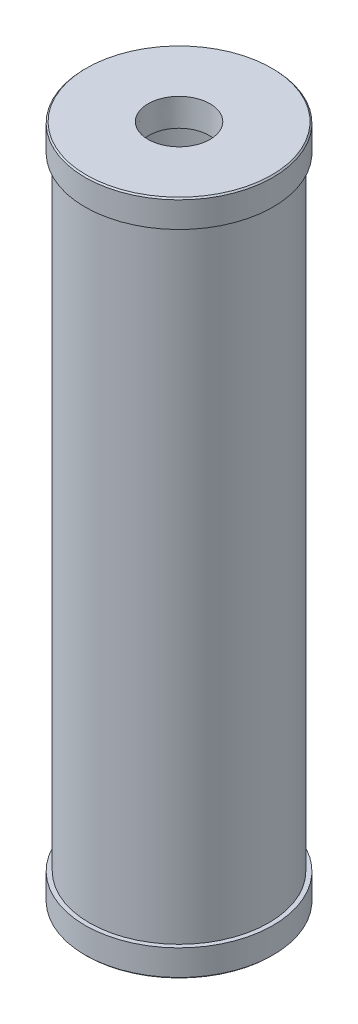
ISO-10303-21;
HEADER;
FILE_DESCRIPTION(('STEP AP214'),'2;1');
FILE_NAME('part.step','',(''),(''),'','','');
FILE_SCHEMA(('AUTOMOTIVE_DESIGN { 1 0 10303 214 1 1 1 1 }'));
ENDSEC;
DATA;
#1=APPLICATION_CONTEXT('core data for automotive mechanical design processes');
#2=APPLICATION_PROTOCOL_DEFINITION('international standard','automotive_design',2000,#1);
#3=PRODUCT_CONTEXT('',#1,'mechanical');
#4=PRODUCT('Part','Part','',(#3));
#5=PRODUCT_RELATED_PRODUCT_CATEGORY('part','',(#4));
#6=PRODUCT_DEFINITION_FORMATION('','',#4);
#7=PRODUCT_DEFINITION_CONTEXT('part definition',#1,'design');
#8=PRODUCT_DEFINITION('design','',#6,#7);
#9=PRODUCT_DEFINITION_SHAPE('','',#8);
#10=(LENGTH_UNIT() NAMED_UNIT(*) SI_UNIT(.MILLI.,.METRE.));
#11=(NAMED_UNIT(*) PLANE_ANGLE_UNIT() SI_UNIT($,.RADIAN.));
#12=(NAMED_UNIT(*) SI_UNIT($,.STERADIAN.) SOLID_ANGLE_UNIT());
#13=UNCERTAINTY_MEASURE_WITH_UNIT(LENGTH_MEASURE(1.E-05),#10,'distance_accuracy_value','');
#14=(GEOMETRIC_REPRESENTATION_CONTEXT(3) GLOBAL_UNCERTAINTY_ASSIGNED_CONTEXT((#13)) GLOBAL_UNIT_ASSIGNED_CONTEXT((#10,
#11,#12)) REPRESENTATION_CONTEXT('',''));
#15=CARTESIAN_POINT('',(0.,0.,0.));
#16=DIRECTION('',(0.,0.,1.));
#17=DIRECTION('',(1.,0.,0.));
#18=AXIS2_PLACEMENT_3D('',#15,#16,#17);
#19=CARTESIAN_POINT('',(0.,25.4,0.));
#20=DIRECTION('',(0.,1.,0.));
#21=DIRECTION('',(0.,0.,1.));
#22=AXIS2_PLACEMENT_3D('',#19,#20,#21);
#23=PLANE('',#22);
#24=CARTESIAN_POINT('',(0.,25.4,0.));
#25=DIRECTION('',(0.,1.,0.));
#26=DIRECTION('',(0.,0.,1.));
#27=AXIS2_PLACEMENT_3D('',#24,#25,#26);
#28=CIRCLE('',#27,28.2731618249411);
#29=CARTESIAN_POINT('',(0.,25.4,28.2731618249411));
#30=VERTEX_POINT('',#29);
#31=EDGE_CURVE('E54',#30,#30,#28,.T.);
#32=ORIENTED_EDGE('',*,*,#31,.F.);
#33=EDGE_LOOP('',(#32));
#34=FACE_BOUND('',#33,.T.);
#35=CARTESIAN_POINT('',(0.,25.4,0.));
#36=DIRECTION('',(0.,1.,0.));
#37=DIRECTION('',(0.,0.,1.));
#38=AXIS2_PLACEMENT_3D('',#35,#36,#37);
#39=CIRCLE('',#38,74.676);
#40=CARTESIAN_POINT('',(0.,25.4,-74.676));
#41=VERTEX_POINT('',#40);
#42=EDGE_CURVE('E67',#41,#41,#39,.T.);
#43=ORIENTED_EDGE('',*,*,#42,.T.);
#44=EDGE_LOOP('',(#43));
#45=FACE_BOUND('',#44,.T.);
#46=ADVANCED_FACE('F33',(#34,#45),#23,.T.);
#47=CARTESIAN_POINT('',(0.,635.,0.));
#48=DIRECTION('',(0.,-1.,0.));
#49=DIRECTION('',(0.,0.,-1.));
#50=AXIS2_PLACEMENT_3D('',#47,#48,#49);
#51=CYLINDRICAL_SURFACE('',#50,74.676);
#52=CARTESIAN_POINT('',(0.,609.6,0.));
#53=DIRECTION('',(0.,1.,0.));
#54=DIRECTION('',(0.,0.,1.));
#55=AXIS2_PLACEMENT_3D('',#52,#53,#54);
#56=CIRCLE('',#55,74.676);
#57=CARTESIAN_POINT('',(0.,609.6,-74.676));
#58=VERTEX_POINT('',#57);
#59=EDGE_CURVE('E63',#58,#58,#56,.T.);
#60=CARTESIAN_POINT('',(0.,25.4,-74.676));
#61=CARTESIAN_POINT('',(0.,31.4854166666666,-74.676));
#62=CARTESIAN_POINT('',(0.,37.5708333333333,-74.676));
#63=CARTESIAN_POINT('',(0.,49.7416666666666,-74.676));
#64=CARTESIAN_POINT('',(0.,55.8270833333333,-74.676));
#65=CARTESIAN_POINT('',(0.,67.9979166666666,-74.676));
#66=CARTESIAN_POINT('',(0.,74.0833333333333,-74.676));
#67=CARTESIAN_POINT('',(0.,86.2541666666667,-74.676));
#68=CARTESIAN_POINT('',(0.,92.3395833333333,-74.676));
#69=CARTESIAN_POINT('',(0.,104.510416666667,-74.676));
#70=CARTESIAN_POINT('',(0.,110.595833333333,-74.676));
#71=CARTESIAN_POINT('',(0.,122.766666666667,-74.676));
#72=CARTESIAN_POINT('',(0.,128.852083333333,-74.676));
#73=CARTESIAN_POINT('',(0.,141.022916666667,-74.676));
#74=CARTESIAN_POINT('',(0.,147.108333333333,-74.676));
#75=CARTESIAN_POINT('',(0.,159.279166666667,-74.676));
#76=CARTESIAN_POINT('',(0.,165.364583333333,-74.676));
#77=CARTESIAN_POINT('',(0.,177.535416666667,-74.676));
#78=CARTESIAN_POINT('',(0.,183.620833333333,-74.676));
#79=CARTESIAN_POINT('',(0.,195.791666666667,-74.676));
#80=CARTESIAN_POINT('',(0.,201.877083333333,-74.676));
#81=CARTESIAN_POINT('',(0.,214.047916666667,-74.676));
#82=CARTESIAN_POINT('',(0.,220.133333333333,-74.676));
#83=CARTESIAN_POINT('',(0.,232.304166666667,-74.676));
#84=CARTESIAN_POINT('',(0.,238.389583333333,-74.676));
#85=CARTESIAN_POINT('',(0.,250.560416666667,-74.676));
#86=CARTESIAN_POINT('',(0.,256.645833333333,-74.676));
#87=CARTESIAN_POINT('',(0.,268.816666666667,-74.676));
#88=CARTESIAN_POINT('',(0.,274.902083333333,-74.676));
#89=CARTESIAN_POINT('',(0.,287.072916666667,-74.676));
#90=CARTESIAN_POINT('',(0.,293.158333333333,-74.676));
#91=CARTESIAN_POINT('',(0.,305.329166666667,-74.676));
#92=CARTESIAN_POINT('',(0.,311.414583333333,-74.676));
#93=CARTESIAN_POINT('',(0.,323.585416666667,-74.676));
#94=CARTESIAN_POINT('',(0.,329.670833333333,-74.676));
#95=CARTESIAN_POINT('',(0.,341.841666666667,-74.676));
#96=CARTESIAN_POINT('',(0.,347.927083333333,-74.676));
#97=CARTESIAN_POINT('',(0.,360.097916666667,-74.676));
#98=CARTESIAN_POINT('',(0.,366.183333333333,-74.676));
#99=CARTESIAN_POINT('',(0.,378.354166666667,-74.676));
#100=CARTESIAN_POINT('',(0.,384.439583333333,-74.676));
#101=CARTESIAN_POINT('',(0.,396.610416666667,-74.676));
#102=CARTESIAN_POINT('',(0.,402.695833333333,-74.676));
#103=CARTESIAN_POINT('',(0.,414.866666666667,-74.676));
#104=CARTESIAN_POINT('',(0.,420.952083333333,-74.676));
#105=CARTESIAN_POINT('',(0.,433.122916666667,-74.676));
#106=CARTESIAN_POINT('',(0.,439.208333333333,-74.676));
#107=CARTESIAN_POINT('',(0.,451.379166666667,-74.676));
#108=CARTESIAN_POINT('',(0.,457.464583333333,-74.676));
#109=CARTESIAN_POINT('',(0.,469.635416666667,-74.676));
#110=CARTESIAN_POINT('',(0.,475.720833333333,-74.676));
#111=CARTESIAN_POINT('',(0.,487.891666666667,-74.676));
#112=CARTESIAN_POINT('',(0.,493.977083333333,-74.676));
#113=CARTESIAN_POINT('',(0.,506.147916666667,-74.676));
#114=CARTESIAN_POINT('',(0.,512.233333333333,-74.676));
#115=CARTESIAN_POINT('',(0.,524.404166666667,-74.676));
#116=CARTESIAN_POINT('',(0.,530.489583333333,-74.676));
#117=CARTESIAN_POINT('',(0.,542.660416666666,-74.676));
#118=CARTESIAN_POINT('',(0.,548.745833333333,-74.676));
#119=CARTESIAN_POINT('',(0.,560.916666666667,-74.676));
#120=CARTESIAN_POINT('',(0.,567.002083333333,-74.676));
#121=CARTESIAN_POINT('',(0.,579.172916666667,-74.676));
#122=CARTESIAN_POINT('',(0.,585.258333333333,-74.676));
#123=CARTESIAN_POINT('',(0.,597.429166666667,-74.676));
#124=CARTESIAN_POINT('',(0.,603.514583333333,-74.676));
#125=CARTESIAN_POINT('',(0.,609.6,-74.676));
#126=B_SPLINE_CURVE_WITH_KNOTS('',3,(#60,#61,#62,#63,#64,#65,#66,#67,#68,#69,#70,#71,#72,#73,
#74,#75,#76,#77,#78,#79,#80,#81,#82,#83,#84,#85,#86,#87,#88,#89,#90,#91,#92,#93,#94,#95,#96,#97,
#98,#99,#100,#101,#102,#103,#104,#105,#106,#107,#108,#109,#110,#111,#112,#113,#114,#115,#116,
#117,#118,#119,#120,#121,#122,#123,#124,#125),.UNSPECIFIED.,.F.,.F.,(4,2,2,2,2,2,2,2,2,2,2,2,2,
2,2,2,2,2,2,2,2,2,2,2,2,2,2,2,2,2,2,2,4),(0.,18.25625,36.5124999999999,54.76875,73.025,91.28125,
109.5375,127.79375,146.05,164.30625,182.5625,200.81875,219.075,237.33125,255.5875,273.84375,
292.1,310.35625,328.6125,346.86875,365.125,383.38125,401.6375,419.89375,438.15,456.40625,
474.6625,492.91875,511.175,529.43125,547.6875,565.94375,584.2),.UNSPECIFIED.);
#127=EDGE_CURVE('BSEAM106',#41,#58,#126,.T.);
#128=ORIENTED_EDGE('',*,*,#42,.F.);
#129=ORIENTED_EDGE('',*,*,#59,.T.);
#130=ORIENTED_EDGE('',*,*,#127,.T.);
#131=ORIENTED_EDGE('',*,*,#127,.F.);
#132=EDGE_LOOP('',(#128,#130,#129,#131));
#133=FACE_BOUND('',#132,.T.);
#134=ADVANCED_FACE('F106',(#133),#51,.F.);
#135=CARTESIAN_POINT('',(0.,609.6,0.));
#136=DIRECTION('',(0.,1.,0.));
#137=DIRECTION('',(0.,0.,1.));
#138=AXIS2_PLACEMENT_3D('',#135,#136,#137);
#139=PLANE('',#138);
#140=CARTESIAN_POINT('',(0.,609.6,0.));
#141=DIRECTION('',(0.,1.,0.));
#142=DIRECTION('',(0.,0.,1.));
#143=AXIS2_PLACEMENT_3D('',#140,#141,#142);
#144=CIRCLE('',#143,28.2731618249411);
#145=CARTESIAN_POINT('',(0.,609.6,28.2731618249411));
#146=VERTEX_POINT('',#145);
#147=EDGE_CURVE('E59',#146,#146,#144,.T.);
#148=ORIENTED_EDGE('',*,*,#147,.T.);
#149=EDGE_LOOP('',(#148));
#150=FACE_BOUND('',#149,.T.);
#151=ORIENTED_EDGE('',*,*,#59,.F.);
#152=EDGE_LOOP('',(#151));
#153=FACE_BOUND('',#152,.T.);
#154=ADVANCED_FACE('F99',(#150,#153),#139,.F.);
#155=CARTESIAN_POINT('',(0.,635.,0.));
#156=DIRECTION('',(0.,1.,0.));
#157=DIRECTION('',(0.,0.,1.));
#158=AXIS2_PLACEMENT_3D('',#155,#156,#157);
#159=CONICAL_SURFACE('',#158,29.066064,0.0312064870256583);
#160=CARTESIAN_POINT('',(0.,635.,0.));
#161=DIRECTION('',(0.,1.,0.));
#162=DIRECTION('',(0.,0.,1.));
#163=AXIS2_PLACEMENT_3D('',#160,#161,#162);
#164=CIRCLE('',#163,29.066064);
#165=CARTESIAN_POINT('',(0.,635.,29.066064));
#166=VERTEX_POINT('',#165);
#167=EDGE_CURVE('E57',#166,#166,#164,.T.);
#168=ORIENTED_EDGE('',*,*,#167,.T.);
#169=EDGE_LOOP('',(#168));
#170=FACE_BOUND('',#169,.T.);
#171=ORIENTED_EDGE('',*,*,#147,.F.);
#172=EDGE_LOOP('',(#171));
#173=FACE_BOUND('',#172,.T.);
#174=ADVANCED_FACE('F123',(#170,#173),#159,.F.);
#175=CARTESIAN_POINT('',(0.,635.,0.));
#176=DIRECTION('',(0.,-1.,0.));
#177=DIRECTION('',(0.,0.,-1.));
#178=AXIS2_PLACEMENT_3D('',#175,#176,#177);
#179=CYLINDRICAL_SURFACE('',#178,84.201);
#180=CARTESIAN_POINT('',(0.,25.4,0.));
#181=DIRECTION('',(0.,1.,0.));
#182=DIRECTION('',(0.,0.,1.));
#183=AXIS2_PLACEMENT_3D('',#180,#181,#182);
#184=CIRCLE('',#183,84.201);
#185=CARTESIAN_POINT('',(0.,25.4,-84.201));
#186=VERTEX_POINT('',#185);
#187=EDGE_CURVE('E70',#186,#186,#184,.T.);
#188=CARTESIAN_POINT('',(0.,609.6,0.));
#189=DIRECTION('',(0.,1.,0.));
#190=DIRECTION('',(0.,0.,1.));
#191=AXIS2_PLACEMENT_3D('',#188,#189,#190);
#192=CIRCLE('',#191,84.201);
#193=CARTESIAN_POINT('',(0.,609.6,-84.201));
#194=VERTEX_POINT('',#193);
#195=EDGE_CURVE('E53',#194,#194,#192,.T.);
#196=CARTESIAN_POINT('',(0.,25.4,-84.201));
#197=CARTESIAN_POINT('',(0.,31.4854166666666,-84.201));
#198=CARTESIAN_POINT('',(0.,37.5708333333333,-84.201));
#199=CARTESIAN_POINT('',(0.,49.7416666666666,-84.201));
#200=CARTESIAN_POINT('',(0.,55.8270833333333,-84.201));
#201=CARTESIAN_POINT('',(0.,67.9979166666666,-84.201));
#202=CARTESIAN_POINT('',(0.,74.0833333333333,-84.201));
#203=CARTESIAN_POINT('',(0.,86.2541666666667,-84.201));
#204=CARTESIAN_POINT('',(0.,92.3395833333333,-84.201));
#205=CARTESIAN_POINT('',(0.,104.510416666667,-84.201));
#206=CARTESIAN_POINT('',(0.,110.595833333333,-84.201));
#207=CARTESIAN_POINT('',(0.,122.766666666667,-84.201));
#208=CARTESIAN_POINT('',(0.,128.852083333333,-84.201));
#209=CARTESIAN_POINT('',(0.,141.022916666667,-84.201));
#210=CARTESIAN_POINT('',(0.,147.108333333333,-84.201));
#211=CARTESIAN_POINT('',(0.,159.279166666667,-84.201));
#212=CARTESIAN_POINT('',(0.,165.364583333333,-84.201));
#213=CARTESIAN_POINT('',(0.,177.535416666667,-84.201));
#214=CARTESIAN_POINT('',(0.,183.620833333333,-84.201));
#215=CARTESIAN_POINT('',(0.,195.791666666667,-84.201));
#216=CARTESIAN_POINT('',(0.,201.877083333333,-84.201));
#217=CARTESIAN_POINT('',(0.,214.047916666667,-84.201));
#218=CARTESIAN_POINT('',(0.,220.133333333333,-84.201));
#219=CARTESIAN_POINT('',(0.,232.304166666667,-84.201));
#220=CARTESIAN_POINT('',(0.,238.389583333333,-84.201));
#221=CARTESIAN_POINT('',(0.,250.560416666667,-84.201));
#222=CARTESIAN_POINT('',(0.,256.645833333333,-84.201));
#223=CARTESIAN_POINT('',(0.,268.816666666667,-84.201));
#224=CARTESIAN_POINT('',(0.,274.902083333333,-84.201));
#225=CARTESIAN_POINT('',(0.,287.072916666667,-84.201));
#226=CARTESIAN_POINT('',(0.,293.158333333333,-84.201));
#227=CARTESIAN_POINT('',(0.,305.329166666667,-84.201));
#228=CARTESIAN_POINT('',(0.,311.414583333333,-84.201));
#229=CARTESIAN_POINT('',(0.,323.585416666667,-84.201));
#230=CARTESIAN_POINT('',(0.,329.670833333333,-84.201));
#231=CARTESIAN_POINT('',(0.,341.841666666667,-84.201));
#232=CARTESIAN_POINT('',(0.,347.927083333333,-84.201));
#233=CARTESIAN_POINT('',(0.,360.097916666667,-84.201));
#234=CARTESIAN_POINT('',(0.,366.183333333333,-84.201));
#235=CARTESIAN_POINT('',(0.,378.354166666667,-84.201));
#236=CARTESIAN_POINT('',(0.,384.439583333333,-84.201));
#237=CARTESIAN_POINT('',(0.,396.610416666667,-84.201));
#238=CARTESIAN_POINT('',(0.,402.695833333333,-84.201));
#239=CARTESIAN_POINT('',(0.,414.866666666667,-84.201));
#240=CARTESIAN_POINT('',(0.,420.952083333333,-84.201));
#241=CARTESIAN_POINT('',(0.,433.122916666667,-84.201));
#242=CARTESIAN_POINT('',(0.,439.208333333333,-84.201));
#243=CARTESIAN_POINT('',(0.,451.379166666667,-84.201));
#244=CARTESIAN_POINT('',(0.,457.464583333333,-84.201));
#245=CARTESIAN_POINT('',(0.,469.635416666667,-84.201));
#246=CARTESIAN_POINT('',(0.,475.720833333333,-84.201));
#247=CARTESIAN_POINT('',(0.,487.891666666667,-84.201));
#248=CARTESIAN_POINT('',(0.,493.977083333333,-84.201));
#249=CARTESIAN_POINT('',(0.,506.147916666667,-84.201));
#250=CARTESIAN_POINT('',(0.,512.233333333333,-84.201));
#251=CARTESIAN_POINT('',(0.,524.404166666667,-84.201));
#252=CARTESIAN_POINT('',(0.,530.489583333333,-84.201));
#253=CARTESIAN_POINT('',(0.,542.660416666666,-84.201));
#254=CARTESIAN_POINT('',(0.,548.745833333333,-84.201));
#255=CARTESIAN_POINT('',(0.,560.916666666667,-84.201));
#256=CARTESIAN_POINT('',(0.,567.002083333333,-84.201));
#257=CARTESIAN_POINT('',(0.,579.172916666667,-84.201));
#258=CARTESIAN_POINT('',(0.,585.258333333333,-84.201));
#259=CARTESIAN_POINT('',(0.,597.429166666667,-84.201));
#260=CARTESIAN_POINT('',(0.,603.514583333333,-84.201));
#261=CARTESIAN_POINT('',(0.,609.6,-84.201));
#262=B_SPLINE_CURVE_WITH_KNOTS('',3,(#196,#197,#198,#199,#200,#201,#202,#203,#204,#205,#206,
#207,#208,#209,#210,#211,#212,#213,#214,#215,#216,#217,#218,#219,#220,#221,#222,#223,#224,#225,
#226,#227,#228,#229,#230,#231,#232,#233,#234,#235,#236,#237,#238,#239,#240,#241,#242,#243,#244,
#245,#246,#247,#248,#249,#250,#251,#252,#253,#254,#255,#256,#257,#258,#259,#260,#261),
.UNSPECIFIED.,.F.,.F.,(4,2,2,2,2,2,2,2,2,2,2,2,2,2,2,2,2,2,2,2,2,2,2,2,2,2,2,2,2,2,2,2,4),(0.,
18.25625,36.5124999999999,54.76875,73.025,91.28125,109.5375,127.79375,146.05,164.30625,182.5625,
200.81875,219.075,237.33125,255.5875,273.84375,292.1,310.35625,328.6125,346.86875,365.125,
383.38125,401.6375,419.89375,438.15,456.40625,474.6625,492.91875,511.175,529.43125,547.6875,
565.94375,584.2),.UNSPECIFIED.);
#263=EDGE_CURVE('BSEAM118',#186,#194,#262,.T.);
#264=ORIENTED_EDGE('',*,*,#187,.T.);
#265=ORIENTED_EDGE('',*,*,#195,.F.);
#266=ORIENTED_EDGE('',*,*,#263,.T.);
#267=ORIENTED_EDGE('',*,*,#263,.F.);
#268=EDGE_LOOP('',(#264,#266,#265,#267));
#269=FACE_BOUND('',#268,.T.);
#270=ADVANCED_FACE('F118',(#269),#179,.T.);
#271=CARTESIAN_POINT('',(0.,25.4,0.));
#272=DIRECTION('',(0.,1.,0.));
#273=DIRECTION('',(0.,0.,1.));
#274=AXIS2_PLACEMENT_3D('',#271,#272,#273);
#275=CIRCLE('',#274,88.265);
#276=CARTESIAN_POINT('',(0.,25.4,88.265));
#277=VERTEX_POINT('',#276);
#278=EDGE_CURVE('E66',#277,#277,#275,.T.);
#279=ORIENTED_EDGE('',*,*,#278,.T.);
#280=EDGE_LOOP('',(#279));
#281=FACE_BOUND('',#280,.T.);
#282=ORIENTED_EDGE('',*,*,#187,.F.);
#283=EDGE_LOOP('',(#282));
#284=FACE_BOUND('',#283,.T.);
#285=ADVANCED_FACE('F100',(#281,#284),#23,.T.);
#286=CARTESIAN_POINT('',(0.,25.4,0.));
#287=DIRECTION('',(0.,-1.,0.));
#288=DIRECTION('',(0.,0.,-1.));
#289=AXIS2_PLACEMENT_3D('',#286,#287,#288);
#290=CYLINDRICAL_SURFACE('',#289,88.265);
#291=CARTESIAN_POINT('',(0.,1.27000000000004,0.));
#292=DIRECTION('',(0.,1.,0.));
#293=DIRECTION('',(0.,0.,1.));
#294=AXIS2_PLACEMENT_3D('',#291,#292,#293);
#295=CIRCLE('',#294,88.265);
#296=CARTESIAN_POINT('',(0.,1.27000000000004,88.265));
#297=VERTEX_POINT('',#296);
#298=EDGE_CURVE('E48',#297,#297,#295,.T.);
#299=ORIENTED_EDGE('',*,*,#298,.T.);
#300=EDGE_LOOP('',(#299));
#301=FACE_BOUND('',#300,.T.);
#302=ORIENTED_EDGE('',*,*,#278,.F.);
#303=EDGE_LOOP('',(#302));
#304=FACE_BOUND('',#303,.T.);
#305=ADVANCED_FACE('F89',(#301,#304),#290,.T.);
#306=CARTESIAN_POINT('',(0.,0.,0.));
#307=DIRECTION('',(0.,1.,0.));
#308=DIRECTION('',(0.,0.,1.));
#309=AXIS2_PLACEMENT_3D('',#306,#307,#308);
#310=PLANE('',#309);
#311=CARTESIAN_POINT('',(0.,0.,0.));
#312=DIRECTION('',(0.,1.,0.));
#313=DIRECTION('',(0.,0.,1.));
#314=AXIS2_PLACEMENT_3D('',#311,#312,#313);
#315=CIRCLE('',#314,86.995);
#316=CARTESIAN_POINT('',(0.,0.,86.995));
#317=VERTEX_POINT('',#316);
#318=EDGE_CURVE('E44',#317,#317,#315,.F.);
#319=ORIENTED_EDGE('',*,*,#318,.T.);
#320=EDGE_LOOP('',(#319));
#321=FACE_BOUND('',#320,.T.);
#322=CARTESIAN_POINT('',(0.,0.,0.));
#323=DIRECTION('',(0.,-1.,0.));
#324=DIRECTION('',(0.,0.,-1.));
#325=AXIS2_PLACEMENT_3D('',#322,#323,#324);
#326=CIRCLE('',#325,29.066064);
#327=CARTESIAN_POINT('',(0.,0.,-29.066064));
#328=VERTEX_POINT('',#327);
#329=EDGE_CURVE('E58',#328,#328,#326,.T.);
#330=ORIENTED_EDGE('',*,*,#329,.F.);
#331=EDGE_LOOP('',(#330));
#332=FACE_BOUND('',#331,.T.);
#333=ADVANCED_FACE('F86',(#321,#332),#310,.F.);
#334=CARTESIAN_POINT('',(0.,609.6,0.));
#335=DIRECTION('',(0.,1.,0.));
#336=DIRECTION('',(0.,0.,1.));
#337=AXIS2_PLACEMENT_3D('',#334,#335,#336);
#338=CIRCLE('',#337,88.265);
#339=CARTESIAN_POINT('',(0.,609.6,88.265));
#340=VERTEX_POINT('',#339);
#341=EDGE_CURVE('E62',#340,#340,#338,.T.);
#342=ORIENTED_EDGE('',*,*,#341,.F.);
#343=EDGE_LOOP('',(#342));
#344=FACE_BOUND('',#343,.T.);
#345=ORIENTED_EDGE('',*,*,#195,.T.);
#346=EDGE_LOOP('',(#345));
#347=FACE_BOUND('',#346,.T.);
#348=ADVANCED_FACE('F88',(#344,#347),#139,.F.);
#349=CARTESIAN_POINT('',(0.,609.6,0.));
#350=DIRECTION('',(0.,1.,0.));
#351=DIRECTION('',(0.,0.,1.));
#352=AXIS2_PLACEMENT_3D('',#349,#350,#351);
#353=CYLINDRICAL_SURFACE('',#352,88.265);
#354=CARTESIAN_POINT('',(0.,633.73,0.));
#355=DIRECTION('',(0.,1.,0.));
#356=DIRECTION('',(0.,0.,1.));
#357=AXIS2_PLACEMENT_3D('',#354,#355,#356);
#358=CIRCLE('',#357,88.265);
#359=CARTESIAN_POINT('',(0.,633.73,88.265));
#360=VERTEX_POINT('',#359);
#361=EDGE_CURVE('E10',#360,#360,#358,.F.);
#362=ORIENTED_EDGE('',*,*,#361,.T.);
#363=EDGE_LOOP('',(#362));
#364=FACE_BOUND('',#363,.T.);
#365=ORIENTED_EDGE('',*,*,#341,.T.);
#366=EDGE_LOOP('',(#365));
#367=FACE_BOUND('',#366,.T.);
#368=ADVANCED_FACE('F96',(#364,#367),#353,.T.);
#369=CARTESIAN_POINT('',(0.,635.,0.));
#370=DIRECTION('',(0.,1.,0.));
#371=DIRECTION('',(0.,0.,1.));
#372=AXIS2_PLACEMENT_3D('',#369,#370,#371);
#373=PLANE('',#372);
#374=CARTESIAN_POINT('',(0.,635.,0.));
#375=DIRECTION('',(0.,1.,0.));
#376=DIRECTION('',(0.,0.,1.));
#377=AXIS2_PLACEMENT_3D('',#374,#375,#376);
#378=CIRCLE('',#377,86.995);
#379=CARTESIAN_POINT('',(0.,635.,86.995));
#380=VERTEX_POINT('',#379);
#381=EDGE_CURVE('E40',#380,#380,#378,.T.);
#382=ORIENTED_EDGE('',*,*,#381,.T.);
#383=EDGE_LOOP('',(#382));
#384=FACE_BOUND('',#383,.T.);
#385=ORIENTED_EDGE('',*,*,#167,.F.);
#386=EDGE_LOOP('',(#385));
#387=FACE_BOUND('',#386,.T.);
#388=ADVANCED_FACE('F145',(#384,#387),#373,.T.);
#389=CARTESIAN_POINT('',(0.,0.,0.));
#390=DIRECTION('',(0.,-1.,0.));
#391=DIRECTION('',(0.,0.,-1.));
#392=AXIS2_PLACEMENT_3D('',#389,#390,#391);
#393=CONICAL_SURFACE('',#392,29.066064,0.0312064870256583);
#394=ORIENTED_EDGE('',*,*,#31,.T.);
#395=EDGE_LOOP('',(#394));
#396=FACE_BOUND('',#395,.T.);
#397=ORIENTED_EDGE('',*,*,#329,.T.);
#398=EDGE_LOOP('',(#397));
#399=FACE_BOUND('',#398,.T.);
#400=ADVANCED_FACE('F84',(#396,#399),#393,.F.);
#401=CARTESIAN_POINT('',(0.,1.27000000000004,0.));
#402=DIRECTION('',(0.,1.,0.));
#403=DIRECTION('',(0.,0.,1.));
#404=AXIS2_PLACEMENT_3D('',#401,#402,#403);
#405=CONICAL_SURFACE('',#404,88.265,0.785398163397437);
#406=ORIENTED_EDGE('',*,*,#318,.F.);
#407=EDGE_LOOP('',(#406));
#408=FACE_BOUND('',#407,.T.);
#409=ORIENTED_EDGE('',*,*,#298,.F.);
#410=EDGE_LOOP('',(#409));
#411=FACE_BOUND('',#410,.T.);
#412=ADVANCED_FACE('F137',(#408,#411),#405,.T.);
#413=CARTESIAN_POINT('',(0.,635.,0.));
#414=DIRECTION('',(0.,-1.,0.));
#415=DIRECTION('',(0.,0.,-1.));
#416=AXIS2_PLACEMENT_3D('',#413,#414,#415);
#417=CONICAL_SURFACE('',#416,86.995,0.785398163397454);
#418=ORIENTED_EDGE('',*,*,#361,.F.);
#419=EDGE_LOOP('',(#418));
#420=FACE_BOUND('',#419,.T.);
#421=ORIENTED_EDGE('',*,*,#381,.F.);
#422=EDGE_LOOP('',(#421));
#423=FACE_BOUND('',#422,.T.);
#424=ADVANCED_FACE('F35',(#420,#423),#417,.T.);
#425=CLOSED_SHELL('',(#46,#134,#154,#174,#270,#285,#305,#333,#348,#368,#388,#400,#412,#424));
#426=MANIFOLD_SOLID_BREP('B2',#425);
#427=ADVANCED_BREP_SHAPE_REPRESENTATION('',(#18,#426),#14);
#428=SHAPE_DEFINITION_REPRESENTATION(#9,#427);
ENDSEC;
END-ISO-10303-21;
